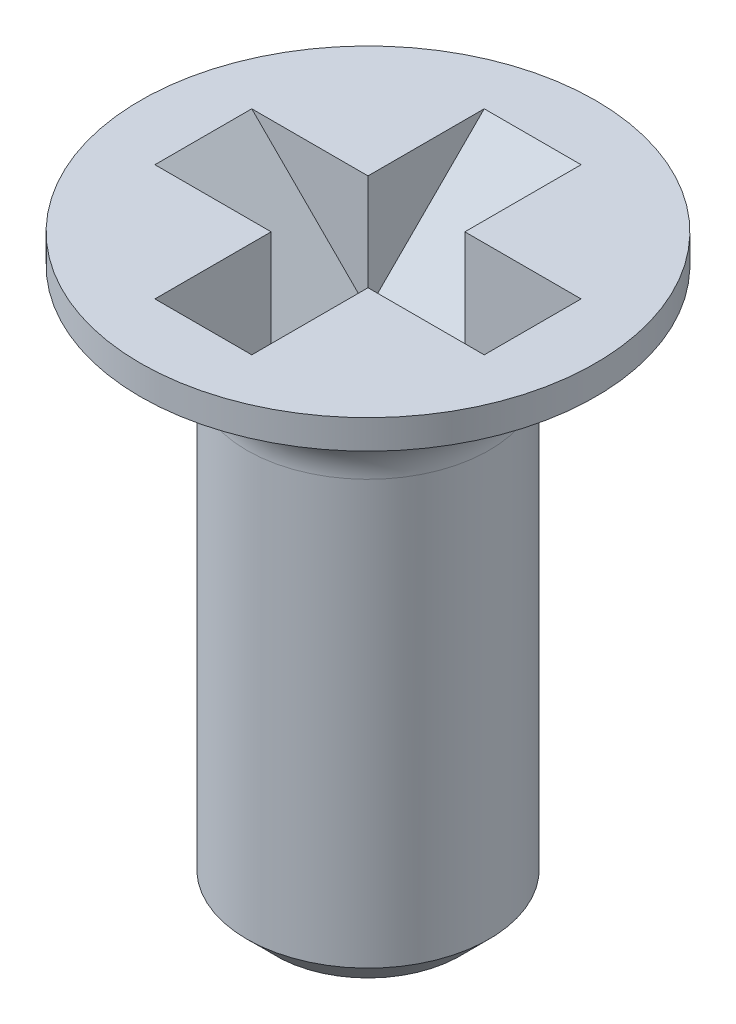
from build123d import *

# Parameters (mm, degrees)
CHAMFER_1_SIZE           = 0.3
CUT_EXTRUDE_1_DEPTH      = 0.5
PATTERN_CIRCULAR_1_COUNT = 4


with BuildPart() as part:
    # Sketch 1 → Revolve 1 (revolve)
    with BuildSketch(Plane.XY, mode=Mode.PRIVATE) as revolve_1_sk:
        with BuildLine():
            Line((0, 0), (-2.35, 0))
            Line((-2.35, 0), (-2.35, -0.3))
            Line((-2.35, -0.3), (-1.527874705, -0.823170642))
            ThreePointArc((-1.527874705, -0.823170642), (-1.324036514, -1.04064204), (-1.25, -1.329367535))
            Line((-1.25, -1.329367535), (-1.25, -6))
            Line((-1.25, -6), (0, -6))
            Line((0, -6), (0, 0))
        make_face()
    revolve(revolve_1_sk.sketch.rotate(Axis((0, 8.010521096, 0), (0, -1, 0)), 270), axis=Axis((0, 8.010521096, 0), (0, -1, 0)))

    # Chamfer 1
    chamfer_1_edges = [part.edges().sort_by_distance(p)[0] for p in [
        (0, -6, -1.25),
    ]]
    chamfer(chamfer_1_edges, length=CHAMFER_1_SIZE)

    # Sketch 2 → Cut-Extrude 1 (cut, symmetric)
    with BuildSketch(Plane.XY):
        Polygon((-0.5, -1.2), (-1.7, 0), (0, 0), (0, -1.2), align=None)
    cut_extrude_1 = extrude(amount=CUT_EXTRUDE_1_DEPTH, both=True, mode=Mode.SUBTRACT)

    # Pattern Circular 1: Cut-Extrude 1 ×4 about axis
    pattern_circular_1_axis = Axis((0, 0, 0), (0, 1, 0))
    for i in range(1, PATTERN_CIRCULAR_1_COUNT):
        add(cut_extrude_1.rotate(pattern_circular_1_axis, i * 360 / PATTERN_CIRCULAR_1_COUNT), mode=Mode.SUBTRACT)


solid = part.part
